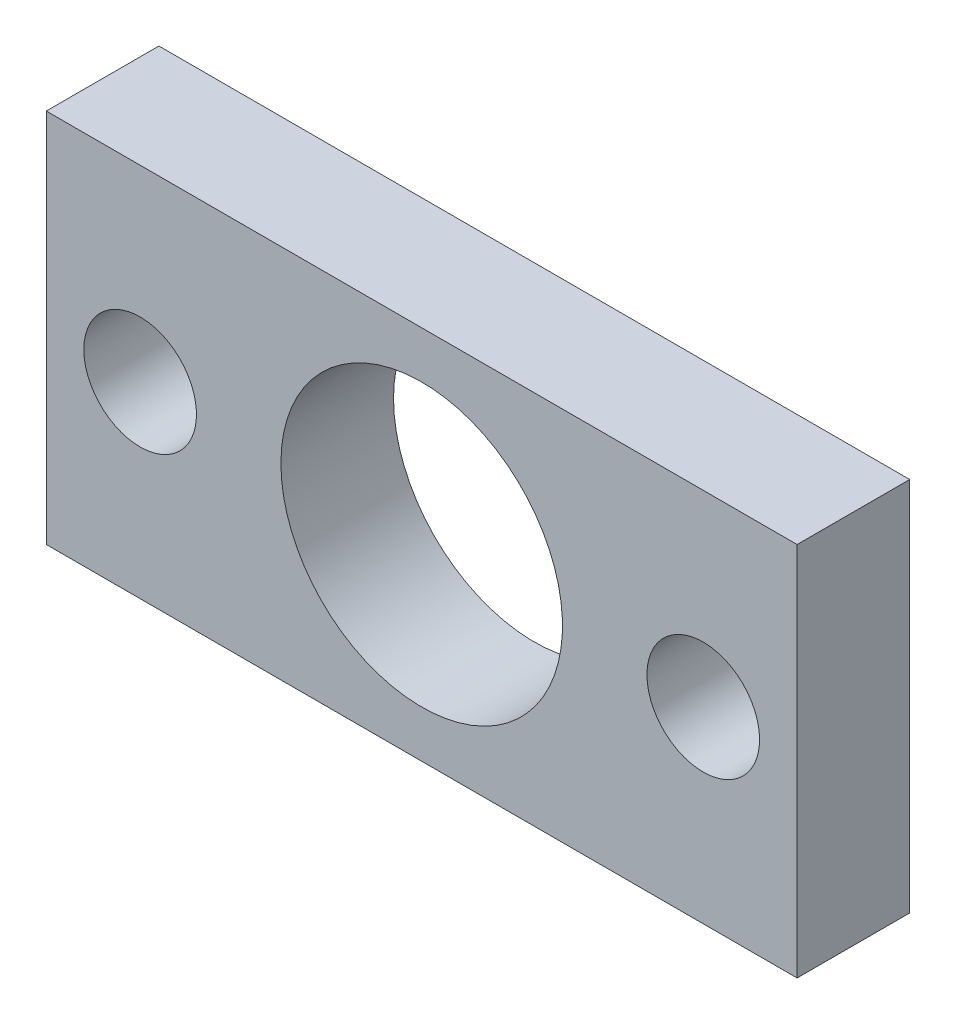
ISO-10303-21;
HEADER;
FILE_DESCRIPTION(('STEP AP214'),'2;1');
FILE_NAME('part.step','',(''),(''),'','','');
FILE_SCHEMA(('AUTOMOTIVE_DESIGN { 1 0 10303 214 1 1 1 1 }'));
ENDSEC;
DATA;
#1=APPLICATION_CONTEXT('core data for automotive mechanical design processes');
#2=APPLICATION_PROTOCOL_DEFINITION('international standard','automotive_design',2000,#1);
#3=PRODUCT_CONTEXT('',#1,'mechanical');
#4=PRODUCT('Part','Part','',(#3));
#5=PRODUCT_RELATED_PRODUCT_CATEGORY('part','',(#4));
#6=PRODUCT_DEFINITION_FORMATION('','',#4);
#7=PRODUCT_DEFINITION_CONTEXT('part definition',#1,'design');
#8=PRODUCT_DEFINITION('design','',#6,#7);
#9=PRODUCT_DEFINITION_SHAPE('','',#8);
#10=(LENGTH_UNIT() NAMED_UNIT(*) SI_UNIT(.MILLI.,.METRE.));
#11=(NAMED_UNIT(*) PLANE_ANGLE_UNIT() SI_UNIT($,.RADIAN.));
#12=(NAMED_UNIT(*) SI_UNIT($,.STERADIAN.) SOLID_ANGLE_UNIT());
#13=UNCERTAINTY_MEASURE_WITH_UNIT(LENGTH_MEASURE(1.E-05),#10,'distance_accuracy_value','');
#14=(GEOMETRIC_REPRESENTATION_CONTEXT(3) GLOBAL_UNCERTAINTY_ASSIGNED_CONTEXT((#13)) GLOBAL_UNIT_ASSIGNED_CONTEXT((#10,
#11,#12)) REPRESENTATION_CONTEXT('',''));
#15=CARTESIAN_POINT('',(0.,0.,0.));
#16=DIRECTION('',(0.,0.,1.));
#17=DIRECTION('',(1.,0.,0.));
#18=AXIS2_PLACEMENT_3D('',#15,#16,#17);
#19=CARTESIAN_POINT('',(0.,12.7,-2.54));
#20=DIRECTION('',(0.,1.,0.));
#21=DIRECTION('',(0.,0.,1.));
#22=AXIS2_PLACEMENT_3D('',#19,#20,#21);
#23=PLANE('',#22);
#24=DIRECTION('',(1.,0.,0.));
#25=VECTOR('',#24,1.);
#26=CARTESIAN_POINT('',(0.,12.7,-6.35));
#27=LINE('',#26,#25);
#28=CARTESIAN_POINT('',(0.,12.7,-6.35));
#29=VERTEX_POINT('',#28);
#30=CARTESIAN_POINT('',(25.4,12.7,-6.35));
#31=VERTEX_POINT('',#30);
#32=EDGE_CURVE('E96',#29,#31,#27,.T.);
#33=ORIENTED_EDGE('',*,*,#32,.F.);
#34=DIRECTION('',(0.,0.,-1.));
#35=VECTOR('',#34,1.);
#36=CARTESIAN_POINT('',(0.,12.7,-2.54));
#37=LINE('',#36,#35);
#38=CARTESIAN_POINT('',(0.,12.7,-2.54));
#39=VERTEX_POINT('',#38);
#40=EDGE_CURVE('E11',#39,#29,#37,.T.);
#41=ORIENTED_EDGE('',*,*,#40,.F.);
#42=DIRECTION('',(1.,0.,0.));
#43=VECTOR('',#42,1.);
#44=CARTESIAN_POINT('',(0.,12.7,-2.54));
#45=LINE('',#44,#43);
#46=CARTESIAN_POINT('',(25.4,12.7,-2.54));
#47=VERTEX_POINT('',#46);
#48=EDGE_CURVE('E89',#39,#47,#45,.T.);
#49=ORIENTED_EDGE('',*,*,#48,.T.);
#50=DIRECTION('',(0.,0.,-1.));
#51=VECTOR('',#50,1.);
#52=CARTESIAN_POINT('',(25.4,12.7,-2.54));
#53=LINE('',#52,#51);
#54=EDGE_CURVE('E34',#47,#31,#53,.T.);
#55=ORIENTED_EDGE('',*,*,#54,.T.);
#56=EDGE_LOOP('',(#33,#41,#49,#55));
#57=FACE_BOUND('',#56,.T.);
#58=ADVANCED_FACE('F31',(#57),#23,.T.);
#59=CARTESIAN_POINT('',(0.,0.,-2.54));
#60=DIRECTION('',(-1.,0.,0.));
#61=DIRECTION('',(0.,0.,1.));
#62=AXIS2_PLACEMENT_3D('',#59,#60,#61);
#63=PLANE('',#62);
#64=DIRECTION('',(0.,1.,0.));
#65=VECTOR('',#64,1.);
#66=CARTESIAN_POINT('',(0.,0.,-6.35));
#67=LINE('',#66,#65);
#68=CARTESIAN_POINT('',(0.,0.,-6.35));
#69=VERTEX_POINT('',#68);
#70=EDGE_CURVE('E91',#69,#29,#67,.T.);
#71=ORIENTED_EDGE('',*,*,#70,.F.);
#72=DIRECTION('',(0.,0.,-1.));
#73=VECTOR('',#72,1.);
#74=CARTESIAN_POINT('',(0.,0.,-2.54));
#75=LINE('',#74,#73);
#76=CARTESIAN_POINT('',(0.,0.,-2.54));
#77=VERTEX_POINT('',#76);
#78=EDGE_CURVE('E40',#77,#69,#75,.T.);
#79=ORIENTED_EDGE('',*,*,#78,.F.);
#80=DIRECTION('',(0.,1.,0.));
#81=VECTOR('',#80,1.);
#82=CARTESIAN_POINT('',(0.,0.,-2.54));
#83=LINE('',#82,#81);
#84=EDGE_CURVE('E86',#77,#39,#83,.T.);
#85=ORIENTED_EDGE('',*,*,#84,.T.);
#86=ORIENTED_EDGE('',*,*,#40,.T.);
#87=EDGE_LOOP('',(#71,#79,#85,#86));
#88=FACE_BOUND('',#87,.T.);
#89=ADVANCED_FACE('F107',(#88),#63,.T.);
#90=CARTESIAN_POINT('',(25.4,0.,-2.54));
#91=DIRECTION('',(0.,-1.,0.));
#92=DIRECTION('',(0.,0.,-1.));
#93=AXIS2_PLACEMENT_3D('',#90,#91,#92);
#94=PLANE('',#93);
#95=DIRECTION('',(-1.,0.,0.));
#96=VECTOR('',#95,1.);
#97=CARTESIAN_POINT('',(25.4,0.,-6.35));
#98=LINE('',#97,#96);
#99=CARTESIAN_POINT('',(25.4,0.,-6.35));
#100=VERTEX_POINT('',#99);
#101=EDGE_CURVE('E81',#100,#69,#98,.T.);
#102=ORIENTED_EDGE('',*,*,#101,.F.);
#103=DIRECTION('',(0.,0.,-1.));
#104=VECTOR('',#103,1.);
#105=CARTESIAN_POINT('',(25.4,0.,-2.54));
#106=LINE('',#105,#104);
#107=CARTESIAN_POINT('',(25.4,0.,-2.54));
#108=VERTEX_POINT('',#107);
#109=EDGE_CURVE('E76',#108,#100,#106,.T.);
#110=ORIENTED_EDGE('',*,*,#109,.F.);
#111=DIRECTION('',(-1.,0.,0.));
#112=VECTOR('',#111,1.);
#113=CARTESIAN_POINT('',(25.4,0.,-2.54));
#114=LINE('',#113,#112);
#115=EDGE_CURVE('E79',#108,#77,#114,.T.);
#116=ORIENTED_EDGE('',*,*,#115,.T.);
#117=ORIENTED_EDGE('',*,*,#78,.T.);
#118=EDGE_LOOP('',(#102,#110,#116,#117));
#119=FACE_BOUND('',#118,.T.);
#120=ADVANCED_FACE('F78',(#119),#94,.T.);
#121=CARTESIAN_POINT('',(25.4,12.7,-2.54));
#122=DIRECTION('',(1.,0.,0.));
#123=DIRECTION('',(0.,0.,-1.));
#124=AXIS2_PLACEMENT_3D('',#121,#122,#123);
#125=PLANE('',#124);
#126=DIRECTION('',(0.,-1.,0.));
#127=VECTOR('',#126,1.);
#128=CARTESIAN_POINT('',(25.4,12.7,-6.35));
#129=LINE('',#128,#127);
#130=EDGE_CURVE('E99',#31,#100,#129,.T.);
#131=ORIENTED_EDGE('',*,*,#130,.F.);
#132=ORIENTED_EDGE('',*,*,#54,.F.);
#133=DIRECTION('',(0.,-1.,0.));
#134=VECTOR('',#133,1.);
#135=CARTESIAN_POINT('',(25.4,12.7,-2.54));
#136=LINE('',#135,#134);
#137=EDGE_CURVE('E85',#47,#108,#136,.T.);
#138=ORIENTED_EDGE('',*,*,#137,.T.);
#139=ORIENTED_EDGE('',*,*,#109,.T.);
#140=EDGE_LOOP('',(#131,#132,#138,#139));
#141=FACE_BOUND('',#140,.T.);
#142=ADVANCED_FACE('F88',(#141),#125,.T.);
#143=CARTESIAN_POINT('',(25.4,12.7,-2.54));
#144=DIRECTION('',(0.,0.,-1.));
#145=DIRECTION('',(-1.,0.,0.));
#146=AXIS2_PLACEMENT_3D('',#143,#144,#145);
#147=PLANE('',#146);
#148=CARTESIAN_POINT('',(12.7,6.35,-2.54));
#149=DIRECTION('',(0.,0.,-1.));
#150=DIRECTION('',(1.,0.,0.));
#151=AXIS2_PLACEMENT_3D('',#148,#149,#150);
#152=CIRCLE('',#151,4.7625);
#153=CARTESIAN_POINT('',(7.9375,6.35,-2.54));
#154=VERTEX_POINT('',#153);
#155=EDGE_CURVE('E144',#154,#154,#152,.T.);
#156=ORIENTED_EDGE('',*,*,#155,.T.);
#157=EDGE_LOOP('',(#156));
#158=FACE_BOUND('',#157,.T.);
#159=CARTESIAN_POINT('',(3.175,6.35,-2.54));
#160=DIRECTION('',(0.,0.,-1.));
#161=DIRECTION('',(1.,0.,0.));
#162=AXIS2_PLACEMENT_3D('',#159,#160,#161);
#163=CIRCLE('',#162,1.905);
#164=CARTESIAN_POINT('',(1.27,6.35,-2.54));
#165=VERTEX_POINT('',#164);
#166=EDGE_CURVE('E152',#165,#165,#163,.T.);
#167=ORIENTED_EDGE('',*,*,#166,.T.);
#168=EDGE_LOOP('',(#167));
#169=FACE_BOUND('',#168,.T.);
#170=CARTESIAN_POINT('',(22.225,6.35,-2.54));
#171=DIRECTION('',(0.,0.,-1.));
#172=DIRECTION('',(1.,0.,0.));
#173=AXIS2_PLACEMENT_3D('',#170,#171,#172);
#174=CIRCLE('',#173,1.905);
#175=CARTESIAN_POINT('',(20.32,6.35,-2.54));
#176=VERTEX_POINT('',#175);
#177=EDGE_CURVE('E100',#176,#176,#174,.T.);
#178=ORIENTED_EDGE('',*,*,#177,.T.);
#179=EDGE_LOOP('',(#178));
#180=FACE_BOUND('',#179,.T.);
#181=ORIENTED_EDGE('',*,*,#48,.F.);
#182=ORIENTED_EDGE('',*,*,#84,.F.);
#183=ORIENTED_EDGE('',*,*,#115,.F.);
#184=ORIENTED_EDGE('',*,*,#137,.F.);
#185=EDGE_LOOP('',(#181,#182,#183,#184));
#186=FACE_BOUND('',#185,.T.);
#187=ADVANCED_FACE('F84',(#158,#169,#180,#186),#147,.F.);
#188=CARTESIAN_POINT('',(25.4,12.7,-6.35));
#189=DIRECTION('',(0.,0.,-1.));
#190=DIRECTION('',(-1.,0.,0.));
#191=AXIS2_PLACEMENT_3D('',#188,#189,#190);
#192=PLANE('',#191);
#193=CARTESIAN_POINT('',(12.7,6.35,-6.35));
#194=DIRECTION('',(0.,0.,-1.));
#195=DIRECTION('',(1.,0.,0.));
#196=AXIS2_PLACEMENT_3D('',#193,#194,#195);
#197=CIRCLE('',#196,4.7625);
#198=CARTESIAN_POINT('',(7.9375,6.35,-6.35));
#199=VERTEX_POINT('',#198);
#200=EDGE_CURVE('E147',#199,#199,#197,.T.);
#201=ORIENTED_EDGE('',*,*,#200,.F.);
#202=EDGE_LOOP('',(#201));
#203=FACE_BOUND('',#202,.T.);
#204=CARTESIAN_POINT('',(3.175,6.35,-6.35));
#205=DIRECTION('',(0.,0.,-1.));
#206=DIRECTION('',(1.,0.,0.));
#207=AXIS2_PLACEMENT_3D('',#204,#205,#206);
#208=CIRCLE('',#207,1.905);
#209=CARTESIAN_POINT('',(1.27,6.35,-6.35));
#210=VERTEX_POINT('',#209);
#211=EDGE_CURVE('E149',#210,#210,#208,.T.);
#212=ORIENTED_EDGE('',*,*,#211,.F.);
#213=EDGE_LOOP('',(#212));
#214=FACE_BOUND('',#213,.T.);
#215=CARTESIAN_POINT('',(22.225,6.35,-6.35));
#216=DIRECTION('',(0.,0.,-1.));
#217=DIRECTION('',(1.,0.,0.));
#218=AXIS2_PLACEMENT_3D('',#215,#216,#217);
#219=CIRCLE('',#218,1.905);
#220=CARTESIAN_POINT('',(20.32,6.35,-6.35));
#221=VERTEX_POINT('',#220);
#222=EDGE_CURVE('E155',#221,#221,#219,.T.);
#223=ORIENTED_EDGE('',*,*,#222,.F.);
#224=EDGE_LOOP('',(#223));
#225=FACE_BOUND('',#224,.T.);
#226=ORIENTED_EDGE('',*,*,#32,.T.);
#227=ORIENTED_EDGE('',*,*,#130,.T.);
#228=ORIENTED_EDGE('',*,*,#101,.T.);
#229=ORIENTED_EDGE('',*,*,#70,.T.);
#230=EDGE_LOOP('',(#226,#227,#228,#229));
#231=FACE_BOUND('',#230,.T.);
#232=ADVANCED_FACE('F106',(#203,#214,#225,#231),#192,.T.);
#233=CARTESIAN_POINT('',(22.225,6.35,-2.54));
#234=DIRECTION('',(0.,0.,-1.));
#235=DIRECTION('',(-1.,0.,0.));
#236=AXIS2_PLACEMENT_3D('',#233,#234,#235);
#237=CYLINDRICAL_SURFACE('',#236,1.905);
#238=CARTESIAN_POINT('',(20.32,6.35,-2.54));
#239=CARTESIAN_POINT('',(20.32,6.35,-2.5796875));
#240=CARTESIAN_POINT('',(20.32,6.35,-2.619375));
#241=CARTESIAN_POINT('',(20.32,6.35,-2.69875));
#242=CARTESIAN_POINT('',(20.32,6.35,-2.7384375));
#243=CARTESIAN_POINT('',(20.32,6.35,-2.8178125));
#244=CARTESIAN_POINT('',(20.32,6.35,-2.8575));
#245=CARTESIAN_POINT('',(20.32,6.35,-2.936875));
#246=CARTESIAN_POINT('',(20.32,6.35,-2.9765625));
#247=CARTESIAN_POINT('',(20.32,6.35,-3.0559375));
#248=CARTESIAN_POINT('',(20.32,6.35,-3.095625));
#249=CARTESIAN_POINT('',(20.32,6.35,-3.175));
#250=CARTESIAN_POINT('',(20.32,6.35,-3.2146875));
#251=CARTESIAN_POINT('',(20.32,6.35,-3.2940625));
#252=CARTESIAN_POINT('',(20.32,6.35,-3.33375));
#253=CARTESIAN_POINT('',(20.32,6.35,-3.413125));
#254=CARTESIAN_POINT('',(20.32,6.35,-3.4528125));
#255=CARTESIAN_POINT('',(20.32,6.35,-3.5321875));
#256=CARTESIAN_POINT('',(20.32,6.35,-3.571875));
#257=CARTESIAN_POINT('',(20.32,6.35,-3.65125));
#258=CARTESIAN_POINT('',(20.32,6.35,-3.6909375));
#259=CARTESIAN_POINT('',(20.32,6.35,-3.7703125));
#260=CARTESIAN_POINT('',(20.32,6.35,-3.81));
#261=CARTESIAN_POINT('',(20.32,6.35,-3.889375));
#262=CARTESIAN_POINT('',(20.32,6.35,-3.9290625));
#263=CARTESIAN_POINT('',(20.32,6.35,-4.0084375));
#264=CARTESIAN_POINT('',(20.32,6.35,-4.048125));
#265=CARTESIAN_POINT('',(20.32,6.35,-4.1275));
#266=CARTESIAN_POINT('',(20.32,6.35,-4.1671875));
#267=CARTESIAN_POINT('',(20.32,6.35,-4.2465625));
#268=CARTESIAN_POINT('',(20.32,6.35,-4.28625));
#269=CARTESIAN_POINT('',(20.32,6.35,-4.365625));
#270=CARTESIAN_POINT('',(20.32,6.35,-4.4053125));
#271=CARTESIAN_POINT('',(20.32,6.35,-4.4846875));
#272=CARTESIAN_POINT('',(20.32,6.35,-4.524375));
#273=CARTESIAN_POINT('',(20.32,6.35,-4.60375));
#274=CARTESIAN_POINT('',(20.32,6.35,-4.6434375));
#275=CARTESIAN_POINT('',(20.32,6.35,-4.7228125));
#276=CARTESIAN_POINT('',(20.32,6.35,-4.7625));
#277=CARTESIAN_POINT('',(20.32,6.35,-4.841875));
#278=CARTESIAN_POINT('',(20.32,6.35,-4.8815625));
#279=CARTESIAN_POINT('',(20.32,6.35,-4.9609375));
#280=CARTESIAN_POINT('',(20.32,6.35,-5.000625));
#281=CARTESIAN_POINT('',(20.32,6.35,-5.08));
#282=CARTESIAN_POINT('',(20.32,6.35,-5.1196875));
#283=CARTESIAN_POINT('',(20.32,6.35,-5.1990625));
#284=CARTESIAN_POINT('',(20.32,6.35,-5.23875));
#285=CARTESIAN_POINT('',(20.32,6.35,-5.318125));
#286=CARTESIAN_POINT('',(20.32,6.35,-5.3578125));
#287=CARTESIAN_POINT('',(20.32,6.35,-5.4371875));
#288=CARTESIAN_POINT('',(20.32,6.35,-5.476875));
#289=CARTESIAN_POINT('',(20.32,6.35,-5.55625));
#290=CARTESIAN_POINT('',(20.32,6.35,-5.5959375));
#291=CARTESIAN_POINT('',(20.32,6.35,-5.6753125));
#292=CARTESIAN_POINT('',(20.32,6.35,-5.715));
#293=CARTESIAN_POINT('',(20.32,6.35,-5.794375));
#294=CARTESIAN_POINT('',(20.32,6.35,-5.8340625));
#295=CARTESIAN_POINT('',(20.32,6.35,-5.9134375));
#296=CARTESIAN_POINT('',(20.32,6.35,-5.953125));
#297=CARTESIAN_POINT('',(20.32,6.35,-6.0325));
#298=CARTESIAN_POINT('',(20.32,6.35,-6.0721875));
#299=CARTESIAN_POINT('',(20.32,6.35,-6.1515625));
#300=CARTESIAN_POINT('',(20.32,6.35,-6.19125));
#301=CARTESIAN_POINT('',(20.32,6.35,-6.270625));
#302=CARTESIAN_POINT('',(20.32,6.35,-6.3103125));
#303=CARTESIAN_POINT('',(20.32,6.35,-6.35));
#304=B_SPLINE_CURVE_WITH_KNOTS('',3,(#238,#239,#240,#241,#242,#243,#244,#245,#246,#247,#248,
#249,#250,#251,#252,#253,#254,#255,#256,#257,#258,#259,#260,#261,#262,#263,#264,#265,#266,#267,
#268,#269,#270,#271,#272,#273,#274,#275,#276,#277,#278,#279,#280,#281,#282,#283,#284,#285,#286,
#287,#288,#289,#290,#291,#292,#293,#294,#295,#296,#297,#298,#299,#300,#301,#302,#303),
.UNSPECIFIED.,.F.,.F.,(4,2,2,2,2,2,2,2,2,2,2,2,2,2,2,2,2,2,2,2,2,2,2,2,2,2,2,2,2,2,2,2,4),(0.,
0.1190625,0.238125,0.357187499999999,0.47625,0.595312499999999,0.714374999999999,
0.833437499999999,0.952499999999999,1.0715625,1.190625,1.3096875,1.42875,1.5478125,1.666875,
1.7859375,1.905,2.0240625,2.143125,2.2621875,2.38125,2.5003125,2.619375,2.7384375,2.8575,
2.9765625,3.095625,3.2146875,3.33375,3.4528125,3.571875,3.6909375,3.81),.UNSPECIFIED.);
#305=EDGE_CURVE('BSEAM125',#176,#221,#304,.T.);
#306=ORIENTED_EDGE('',*,*,#177,.F.);
#307=ORIENTED_EDGE('',*,*,#222,.T.);
#308=ORIENTED_EDGE('',*,*,#305,.T.);
#309=ORIENTED_EDGE('',*,*,#305,.F.);
#310=EDGE_LOOP('',(#306,#308,#307,#309));
#311=FACE_BOUND('',#310,.T.);
#312=ADVANCED_FACE('F125',(#311),#237,.F.);
#313=CARTESIAN_POINT('',(3.175,6.35,-2.54));
#314=DIRECTION('',(0.,0.,-1.));
#315=DIRECTION('',(-1.,0.,0.));
#316=AXIS2_PLACEMENT_3D('',#313,#314,#315);
#317=CYLINDRICAL_SURFACE('',#316,1.905);
#318=CARTESIAN_POINT('',(1.27,6.35,-2.54));
#319=CARTESIAN_POINT('',(1.27,6.35,-2.5796875));
#320=CARTESIAN_POINT('',(1.27,6.35,-2.619375));
#321=CARTESIAN_POINT('',(1.27,6.35,-2.69875));
#322=CARTESIAN_POINT('',(1.27,6.35,-2.7384375));
#323=CARTESIAN_POINT('',(1.27,6.35,-2.8178125));
#324=CARTESIAN_POINT('',(1.27,6.35,-2.8575));
#325=CARTESIAN_POINT('',(1.27,6.35,-2.936875));
#326=CARTESIAN_POINT('',(1.27,6.35,-2.9765625));
#327=CARTESIAN_POINT('',(1.27,6.35,-3.0559375));
#328=CARTESIAN_POINT('',(1.27,6.35,-3.095625));
#329=CARTESIAN_POINT('',(1.27,6.35,-3.175));
#330=CARTESIAN_POINT('',(1.27,6.35,-3.2146875));
#331=CARTESIAN_POINT('',(1.27,6.35,-3.2940625));
#332=CARTESIAN_POINT('',(1.27,6.35,-3.33375));
#333=CARTESIAN_POINT('',(1.27,6.35,-3.413125));
#334=CARTESIAN_POINT('',(1.27,6.35,-3.4528125));
#335=CARTESIAN_POINT('',(1.27,6.35,-3.5321875));
#336=CARTESIAN_POINT('',(1.27,6.35,-3.571875));
#337=CARTESIAN_POINT('',(1.27,6.35,-3.65125));
#338=CARTESIAN_POINT('',(1.27,6.35,-3.6909375));
#339=CARTESIAN_POINT('',(1.27,6.35,-3.7703125));
#340=CARTESIAN_POINT('',(1.27,6.35,-3.81));
#341=CARTESIAN_POINT('',(1.27,6.35,-3.889375));
#342=CARTESIAN_POINT('',(1.27,6.35,-3.9290625));
#343=CARTESIAN_POINT('',(1.27,6.35,-4.0084375));
#344=CARTESIAN_POINT('',(1.27,6.35,-4.048125));
#345=CARTESIAN_POINT('',(1.27,6.35,-4.1275));
#346=CARTESIAN_POINT('',(1.27,6.35,-4.1671875));
#347=CARTESIAN_POINT('',(1.27,6.35,-4.2465625));
#348=CARTESIAN_POINT('',(1.27,6.35,-4.28625));
#349=CARTESIAN_POINT('',(1.27,6.35,-4.365625));
#350=CARTESIAN_POINT('',(1.27,6.35,-4.4053125));
#351=CARTESIAN_POINT('',(1.27,6.35,-4.4846875));
#352=CARTESIAN_POINT('',(1.27,6.35,-4.524375));
#353=CARTESIAN_POINT('',(1.27,6.35,-4.60375));
#354=CARTESIAN_POINT('',(1.27,6.35,-4.6434375));
#355=CARTESIAN_POINT('',(1.27,6.35,-4.7228125));
#356=CARTESIAN_POINT('',(1.27,6.35,-4.7625));
#357=CARTESIAN_POINT('',(1.27,6.35,-4.841875));
#358=CARTESIAN_POINT('',(1.27,6.35,-4.8815625));
#359=CARTESIAN_POINT('',(1.27,6.35,-4.9609375));
#360=CARTESIAN_POINT('',(1.27,6.35,-5.000625));
#361=CARTESIAN_POINT('',(1.27,6.35,-5.08));
#362=CARTESIAN_POINT('',(1.27,6.35,-5.1196875));
#363=CARTESIAN_POINT('',(1.27,6.35,-5.1990625));
#364=CARTESIAN_POINT('',(1.27,6.35,-5.23875));
#365=CARTESIAN_POINT('',(1.27,6.35,-5.318125));
#366=CARTESIAN_POINT('',(1.27,6.35,-5.3578125));
#367=CARTESIAN_POINT('',(1.27,6.35,-5.4371875));
#368=CARTESIAN_POINT('',(1.27,6.35,-5.476875));
#369=CARTESIAN_POINT('',(1.27,6.35,-5.55625));
#370=CARTESIAN_POINT('',(1.27,6.35,-5.5959375));
#371=CARTESIAN_POINT('',(1.27,6.35,-5.6753125));
#372=CARTESIAN_POINT('',(1.27,6.35,-5.715));
#373=CARTESIAN_POINT('',(1.27,6.35,-5.794375));
#374=CARTESIAN_POINT('',(1.27,6.35,-5.8340625));
#375=CARTESIAN_POINT('',(1.27,6.35,-5.9134375));
#376=CARTESIAN_POINT('',(1.27,6.35,-5.953125));
#377=CARTESIAN_POINT('',(1.27,6.35,-6.0325));
#378=CARTESIAN_POINT('',(1.27,6.35,-6.0721875));
#379=CARTESIAN_POINT('',(1.27,6.35,-6.1515625));
#380=CARTESIAN_POINT('',(1.27,6.35,-6.19125));
#381=CARTESIAN_POINT('',(1.27,6.35,-6.270625));
#382=CARTESIAN_POINT('',(1.27,6.35,-6.3103125));
#383=CARTESIAN_POINT('',(1.27,6.35,-6.35));
#384=B_SPLINE_CURVE_WITH_KNOTS('',3,(#318,#319,#320,#321,#322,#323,#324,#325,#326,#327,#328,
#329,#330,#331,#332,#333,#334,#335,#336,#337,#338,#339,#340,#341,#342,#343,#344,#345,#346,#347,
#348,#349,#350,#351,#352,#353,#354,#355,#356,#357,#358,#359,#360,#361,#362,#363,#364,#365,#366,
#367,#368,#369,#370,#371,#372,#373,#374,#375,#376,#377,#378,#379,#380,#381,#382,#383),
.UNSPECIFIED.,.F.,.F.,(4,2,2,2,2,2,2,2,2,2,2,2,2,2,2,2,2,2,2,2,2,2,2,2,2,2,2,2,2,2,2,2,4),(0.,
0.1190625,0.238125,0.357187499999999,0.47625,0.595312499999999,0.714374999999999,
0.833437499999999,0.952499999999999,1.0715625,1.190625,1.3096875,1.42875,1.5478125,1.666875,
1.7859375,1.905,2.0240625,2.143125,2.2621875,2.38125,2.5003125,2.619375,2.7384375,2.8575,
2.9765625,3.095625,3.2146875,3.33375,3.4528125,3.571875,3.6909375,3.81),.UNSPECIFIED.);
#385=EDGE_CURVE('BSEAM132',#165,#210,#384,.T.);
#386=ORIENTED_EDGE('',*,*,#166,.F.);
#387=ORIENTED_EDGE('',*,*,#211,.T.);
#388=ORIENTED_EDGE('',*,*,#385,.T.);
#389=ORIENTED_EDGE('',*,*,#385,.F.);
#390=EDGE_LOOP('',(#386,#388,#387,#389));
#391=FACE_BOUND('',#390,.T.);
#392=ADVANCED_FACE('F132',(#391),#317,.F.);
#393=CARTESIAN_POINT('',(12.7,6.35,-2.54));
#394=DIRECTION('',(0.,0.,-1.));
#395=DIRECTION('',(-1.,0.,0.));
#396=AXIS2_PLACEMENT_3D('',#393,#394,#395);
#397=CYLINDRICAL_SURFACE('',#396,4.7625);
#398=CARTESIAN_POINT('',(7.9375,6.35,-2.54));
#399=CARTESIAN_POINT('',(7.9375,6.35,-2.5796875));
#400=CARTESIAN_POINT('',(7.9375,6.35,-2.619375));
#401=CARTESIAN_POINT('',(7.9375,6.35,-2.69875));
#402=CARTESIAN_POINT('',(7.9375,6.35,-2.7384375));
#403=CARTESIAN_POINT('',(7.9375,6.35,-2.8178125));
#404=CARTESIAN_POINT('',(7.9375,6.35,-2.8575));
#405=CARTESIAN_POINT('',(7.9375,6.35,-2.936875));
#406=CARTESIAN_POINT('',(7.9375,6.35,-2.9765625));
#407=CARTESIAN_POINT('',(7.9375,6.35,-3.0559375));
#408=CARTESIAN_POINT('',(7.9375,6.35,-3.095625));
#409=CARTESIAN_POINT('',(7.9375,6.35,-3.175));
#410=CARTESIAN_POINT('',(7.9375,6.35,-3.2146875));
#411=CARTESIAN_POINT('',(7.9375,6.35,-3.2940625));
#412=CARTESIAN_POINT('',(7.9375,6.35,-3.33375));
#413=CARTESIAN_POINT('',(7.9375,6.35,-3.413125));
#414=CARTESIAN_POINT('',(7.9375,6.35,-3.4528125));
#415=CARTESIAN_POINT('',(7.9375,6.35,-3.5321875));
#416=CARTESIAN_POINT('',(7.9375,6.35,-3.571875));
#417=CARTESIAN_POINT('',(7.9375,6.35,-3.65125));
#418=CARTESIAN_POINT('',(7.9375,6.35,-3.6909375));
#419=CARTESIAN_POINT('',(7.9375,6.35,-3.7703125));
#420=CARTESIAN_POINT('',(7.9375,6.35,-3.81));
#421=CARTESIAN_POINT('',(7.9375,6.35,-3.889375));
#422=CARTESIAN_POINT('',(7.9375,6.35,-3.9290625));
#423=CARTESIAN_POINT('',(7.9375,6.35,-4.0084375));
#424=CARTESIAN_POINT('',(7.9375,6.35,-4.048125));
#425=CARTESIAN_POINT('',(7.9375,6.35,-4.1275));
#426=CARTESIAN_POINT('',(7.9375,6.35,-4.1671875));
#427=CARTESIAN_POINT('',(7.9375,6.35,-4.2465625));
#428=CARTESIAN_POINT('',(7.9375,6.35,-4.28625));
#429=CARTESIAN_POINT('',(7.9375,6.35,-4.365625));
#430=CARTESIAN_POINT('',(7.9375,6.35,-4.4053125));
#431=CARTESIAN_POINT('',(7.9375,6.35,-4.4846875));
#432=CARTESIAN_POINT('',(7.9375,6.35,-4.524375));
#433=CARTESIAN_POINT('',(7.9375,6.35,-4.60375));
#434=CARTESIAN_POINT('',(7.9375,6.35,-4.6434375));
#435=CARTESIAN_POINT('',(7.9375,6.35,-4.7228125));
#436=CARTESIAN_POINT('',(7.9375,6.35,-4.7625));
#437=CARTESIAN_POINT('',(7.9375,6.35,-4.841875));
#438=CARTESIAN_POINT('',(7.9375,6.35,-4.8815625));
#439=CARTESIAN_POINT('',(7.9375,6.35,-4.9609375));
#440=CARTESIAN_POINT('',(7.9375,6.35,-5.000625));
#441=CARTESIAN_POINT('',(7.9375,6.35,-5.08));
#442=CARTESIAN_POINT('',(7.9375,6.35,-5.1196875));
#443=CARTESIAN_POINT('',(7.9375,6.35,-5.1990625));
#444=CARTESIAN_POINT('',(7.9375,6.35,-5.23875));
#445=CARTESIAN_POINT('',(7.9375,6.35,-5.318125));
#446=CARTESIAN_POINT('',(7.9375,6.35,-5.3578125));
#447=CARTESIAN_POINT('',(7.9375,6.35,-5.4371875));
#448=CARTESIAN_POINT('',(7.9375,6.35,-5.476875));
#449=CARTESIAN_POINT('',(7.9375,6.35,-5.55625));
#450=CARTESIAN_POINT('',(7.9375,6.35,-5.5959375));
#451=CARTESIAN_POINT('',(7.9375,6.35,-5.6753125));
#452=CARTESIAN_POINT('',(7.9375,6.35,-5.715));
#453=CARTESIAN_POINT('',(7.9375,6.35,-5.794375));
#454=CARTESIAN_POINT('',(7.9375,6.35,-5.8340625));
#455=CARTESIAN_POINT('',(7.9375,6.35,-5.9134375));
#456=CARTESIAN_POINT('',(7.9375,6.35,-5.953125));
#457=CARTESIAN_POINT('',(7.9375,6.35,-6.0325));
#458=CARTESIAN_POINT('',(7.9375,6.35,-6.0721875));
#459=CARTESIAN_POINT('',(7.9375,6.35,-6.1515625));
#460=CARTESIAN_POINT('',(7.9375,6.35,-6.19125));
#461=CARTESIAN_POINT('',(7.9375,6.35,-6.270625));
#462=CARTESIAN_POINT('',(7.9375,6.35,-6.3103125));
#463=CARTESIAN_POINT('',(7.9375,6.35,-6.35));
#464=B_SPLINE_CURVE_WITH_KNOTS('',3,(#398,#399,#400,#401,#402,#403,#404,#405,#406,#407,#408,
#409,#410,#411,#412,#413,#414,#415,#416,#417,#418,#419,#420,#421,#422,#423,#424,#425,#426,#427,
#428,#429,#430,#431,#432,#433,#434,#435,#436,#437,#438,#439,#440,#441,#442,#443,#444,#445,#446,
#447,#448,#449,#450,#451,#452,#453,#454,#455,#456,#457,#458,#459,#460,#461,#462,#463),
.UNSPECIFIED.,.F.,.F.,(4,2,2,2,2,2,2,2,2,2,2,2,2,2,2,2,2,2,2,2,2,2,2,2,2,2,2,2,2,2,2,2,4),(0.,
0.1190625,0.238125,0.3571875,0.47625,0.5953125,0.714375,0.8334375,0.9525,1.0715625,1.190625,
1.3096875,1.42875,1.5478125,1.666875,1.7859375,1.905,2.0240625,2.143125,2.2621875,2.38125,
2.5003125,2.619375,2.7384375,2.8575,2.9765625,3.095625,3.2146875,3.33375,3.4528125,3.571875,
3.6909375,3.81),.UNSPECIFIED.);
#465=EDGE_CURVE('BSEAM136',#154,#199,#464,.T.);
#466=ORIENTED_EDGE('',*,*,#155,.F.);
#467=ORIENTED_EDGE('',*,*,#200,.T.);
#468=ORIENTED_EDGE('',*,*,#465,.T.);
#469=ORIENTED_EDGE('',*,*,#465,.F.);
#470=EDGE_LOOP('',(#466,#468,#467,#469));
#471=FACE_BOUND('',#470,.T.);
#472=ADVANCED_FACE('F136',(#471),#397,.F.);
#473=CLOSED_SHELL('',(#58,#89,#120,#142,#187,#232,#312,#392,#472));
#474=MANIFOLD_SOLID_BREP('B2',#473);
#475=ADVANCED_BREP_SHAPE_REPRESENTATION('',(#18,#474),#14);
#476=SHAPE_DEFINITION_REPRESENTATION(#9,#475);
ENDSEC;
END-ISO-10303-21;
